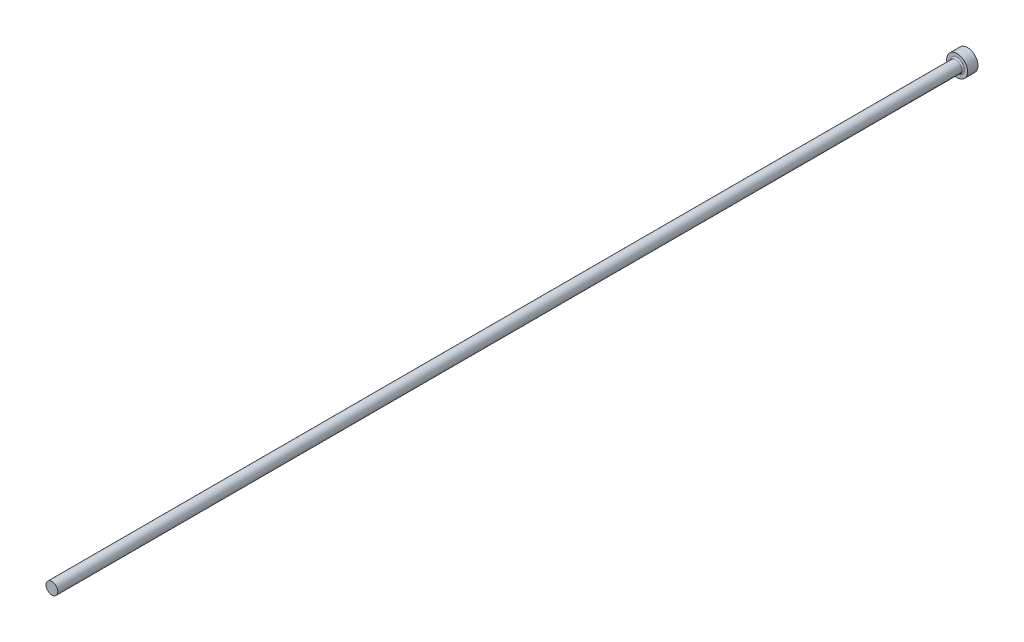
ISO-10303-21;
HEADER;
FILE_DESCRIPTION(('STEP AP214'),'2;1');
FILE_NAME('part.step','',(''),(''),'','','');
FILE_SCHEMA(('AUTOMOTIVE_DESIGN { 1 0 10303 214 1 1 1 1 }'));
ENDSEC;
DATA;
#1=APPLICATION_CONTEXT('core data for automotive mechanical design processes');
#2=APPLICATION_PROTOCOL_DEFINITION('international standard','automotive_design',2000,#1);
#3=PRODUCT_CONTEXT('',#1,'mechanical');
#4=PRODUCT('Part','Part','',(#3));
#5=PRODUCT_RELATED_PRODUCT_CATEGORY('part','',(#4));
#6=PRODUCT_DEFINITION_FORMATION('','',#4);
#7=PRODUCT_DEFINITION_CONTEXT('part definition',#1,'design');
#8=PRODUCT_DEFINITION('design','',#6,#7);
#9=PRODUCT_DEFINITION_SHAPE('','',#8);
#10=(LENGTH_UNIT() NAMED_UNIT(*) SI_UNIT(.MILLI.,.METRE.));
#11=(NAMED_UNIT(*) PLANE_ANGLE_UNIT() SI_UNIT($,.RADIAN.));
#12=(NAMED_UNIT(*) SI_UNIT($,.STERADIAN.) SOLID_ANGLE_UNIT());
#13=UNCERTAINTY_MEASURE_WITH_UNIT(LENGTH_MEASURE(1.E-05),#10,'distance_accuracy_value','');
#14=(GEOMETRIC_REPRESENTATION_CONTEXT(3) GLOBAL_UNCERTAINTY_ASSIGNED_CONTEXT((#13)) GLOBAL_UNIT_ASSIGNED_CONTEXT((#10,
#11,#12)) REPRESENTATION_CONTEXT('',''));
#15=CARTESIAN_POINT('',(0.,0.,0.));
#16=DIRECTION('',(0.,0.,1.));
#17=DIRECTION('',(1.,0.,0.));
#18=AXIS2_PLACEMENT_3D('',#15,#16,#17);
#19=CARTESIAN_POINT('',(4.,0.,4.));
#20=DIRECTION('',(0.,0.,-1.));
#21=DIRECTION('',(-1.,0.,0.));
#22=AXIS2_PLACEMENT_3D('',#19,#20,#21);
#23=PLANE('',#22);
#24=CARTESIAN_POINT('',(0.,0.,4.));
#25=DIRECTION('',(0.,0.,-1.));
#26=DIRECTION('',(-1.,0.,0.));
#27=AXIS2_PLACEMENT_3D('',#24,#25,#26);
#28=CIRCLE('',#27,2.75000000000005);
#29=CARTESIAN_POINT('',(-2.75000000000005,0.,4.));
#30=VERTEX_POINT('',#29);
#31=EDGE_CURVE('E40',#30,#30,#28,.T.);
#32=ORIENTED_EDGE('',*,*,#31,.T.);
#33=EDGE_LOOP('',(#32));
#34=FACE_BOUND('',#33,.T.);
#35=CARTESIAN_POINT('',(0.,0.,4.));
#36=DIRECTION('',(0.,0.,-1.));
#37=DIRECTION('',(-1.,0.,0.));
#38=AXIS2_PLACEMENT_3D('',#35,#36,#37);
#39=CIRCLE('',#38,4.);
#40=CARTESIAN_POINT('',(-4.,0.,4.));
#41=VERTEX_POINT('',#40);
#42=EDGE_CURVE('E44',#41,#41,#39,.T.);
#43=ORIENTED_EDGE('',*,*,#42,.F.);
#44=EDGE_LOOP('',(#43));
#45=FACE_BOUND('',#44,.T.);
#46=ADVANCED_FACE('F33',(#34,#45),#23,.F.);
#47=CARTESIAN_POINT('',(0.,0.,-9.03322817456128));
#48=DIRECTION('',(0.,0.,-1.));
#49=DIRECTION('',(-1.,0.,0.));
#50=AXIS2_PLACEMENT_3D('',#47,#48,#49);
#51=CYLINDRICAL_SURFACE('',#50,4.);
#52=CARTESIAN_POINT('',(0.,0.,0.));
#53=DIRECTION('',(0.,0.,-1.));
#54=DIRECTION('',(-1.,0.,0.));
#55=AXIS2_PLACEMENT_3D('',#52,#53,#54);
#56=CIRCLE('',#55,4.);
#57=CARTESIAN_POINT('',(-4.,0.,0.));
#58=VERTEX_POINT('',#57);
#59=EDGE_CURVE('E48',#58,#58,#56,.T.);
#60=ORIENTED_EDGE('',*,*,#59,.F.);
#61=EDGE_LOOP('',(#60));
#62=FACE_BOUND('',#61,.T.);
#63=ORIENTED_EDGE('',*,*,#42,.T.);
#64=EDGE_LOOP('',(#63));
#65=FACE_BOUND('',#64,.T.);
#66=ADVANCED_FACE('F68',(#62,#65),#51,.T.);
#67=CARTESIAN_POINT('',(0.,0.,0.));
#68=DIRECTION('',(0.,0.,1.));
#69=DIRECTION('',(1.,0.,0.));
#70=AXIS2_PLACEMENT_3D('',#67,#68,#69);
#71=PLANE('',#70);
#72=ORIENTED_EDGE('',*,*,#59,.T.);
#73=EDGE_LOOP('',(#72));
#74=FACE_BOUND('',#73,.T.);
#75=ADVANCED_FACE('F61',(#74),#71,.F.);
#76=CARTESIAN_POINT('',(0.,0.,350.));
#77=DIRECTION('',(0.,0.,-1.));
#78=DIRECTION('',(-1.,0.,0.));
#79=AXIS2_PLACEMENT_3D('',#76,#77,#78);
#80=PLANE('',#79);
#81=CARTESIAN_POINT('',(0.,0.,350.));
#82=DIRECTION('',(0.,0.,-1.));
#83=DIRECTION('',(-1.,0.,0.));
#84=AXIS2_PLACEMENT_3D('',#81,#82,#83);
#85=CIRCLE('',#84,2.25000000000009);
#86=CARTESIAN_POINT('',(-2.25000000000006,0.,350.));
#87=VERTEX_POINT('',#86);
#88=EDGE_CURVE('E53',#87,#87,#85,.T.);
#89=ORIENTED_EDGE('',*,*,#88,.F.);
#90=EDGE_LOOP('',(#89));
#91=FACE_BOUND('',#90,.T.);
#92=ADVANCED_FACE('F59',(#91),#80,.F.);
#93=CARTESIAN_POINT('',(0.,0.,-9.03322817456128));
#94=DIRECTION('',(0.,0.,-1.));
#95=DIRECTION('',(-1.,0.,0.));
#96=AXIS2_PLACEMENT_3D('',#93,#94,#95);
#97=CYLINDRICAL_SURFACE('',#96,2.25000000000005);
#98=CARTESIAN_POINT('',(0.,0.,4.5));
#99=DIRECTION('',(0.,0.,-1.));
#100=DIRECTION('',(-1.,0.,0.));
#101=AXIS2_PLACEMENT_3D('',#98,#99,#100);
#102=CIRCLE('',#101,2.25000000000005);
#103=CARTESIAN_POINT('',(-2.25000000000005,0.,4.5));
#104=VERTEX_POINT('',#103);
#105=EDGE_CURVE('E10',#104,#104,#102,.F.);
#106=ORIENTED_EDGE('',*,*,#105,.T.);
#107=EDGE_LOOP('',(#106));
#108=FACE_BOUND('',#107,.T.);
#109=ORIENTED_EDGE('',*,*,#88,.T.);
#110=EDGE_LOOP('',(#109));
#111=FACE_BOUND('',#110,.T.);
#112=ADVANCED_FACE('F57',(#108,#111),#97,.T.);
#113=CARTESIAN_POINT('',(0.,0.,4.5));
#114=DIRECTION('',(0.,0.,-1.));
#115=DIRECTION('',(-1.,0.,0.));
#116=AXIS2_PLACEMENT_3D('',#113,#114,#115);
#117=TOROIDAL_SURFACE('',#116,2.75000000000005,0.5);
#118=ORIENTED_EDGE('',*,*,#105,.F.);
#119=EDGE_LOOP('',(#118));
#120=FACE_BOUND('',#119,.T.);
#121=ORIENTED_EDGE('',*,*,#31,.F.);
#122=EDGE_LOOP('',(#121));
#123=FACE_BOUND('',#122,.T.);
#124=ADVANCED_FACE('F35',(#120,#123),#117,.F.);
#125=CLOSED_SHELL('',(#46,#66,#75,#92,#112,#124));
#126=MANIFOLD_SOLID_BREP('B2',#125);
#127=ADVANCED_BREP_SHAPE_REPRESENTATION('',(#18,#126),#14);
#128=SHAPE_DEFINITION_REPRESENTATION(#9,#127);
ENDSEC;
END-ISO-10303-21;
